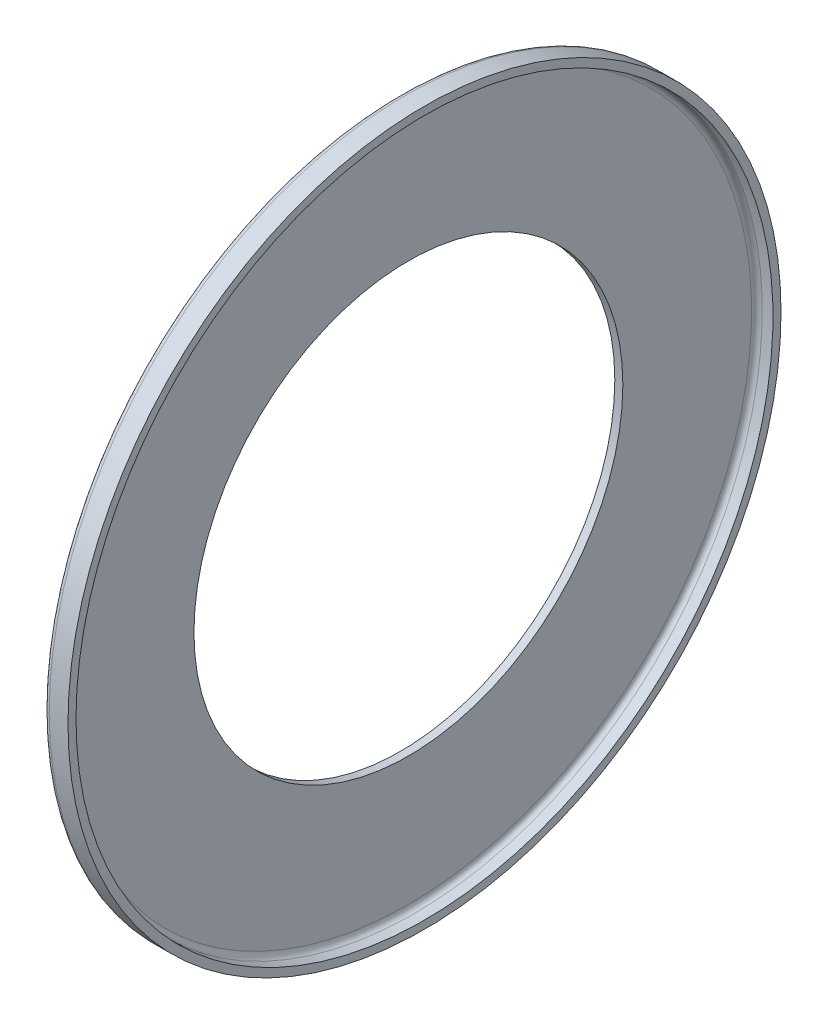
from build123d import *


with BuildPart() as part:
    # Esquisse1 → Base-R_volution (revolve)
    with BuildSketch(Plane.XY, mode=Mode.PRIVATE) as base_r_volution_sk:
        with BuildLine():
            Line((-30, 65.5), (-30, 40))
            Line((-30, 40), (-28.5, 40))
            Line((-28.5, 40), (-28.5, 64))
            ThreePointArc((-28.5, 64), (-28.207106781, 64.707106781), (-27.5, 65))
            Line((-27.5, 65), (-25.5, 65))
            Line((-25.5, 65), (-25.5, 66.5))
            Line((-25.5, 66.5), (-29, 66.5))
            ThreePointArc((-29, 66.5), (-29.707106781, 66.207106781), (-30, 65.5))
        make_face()
    revolve(base_r_volution_sk.sketch.rotate(Axis((-100, 0, 0), (1, 0, 0)), 90), axis=Axis((-100, 0, 0), (1, 0, 0)))


solid = part.part
